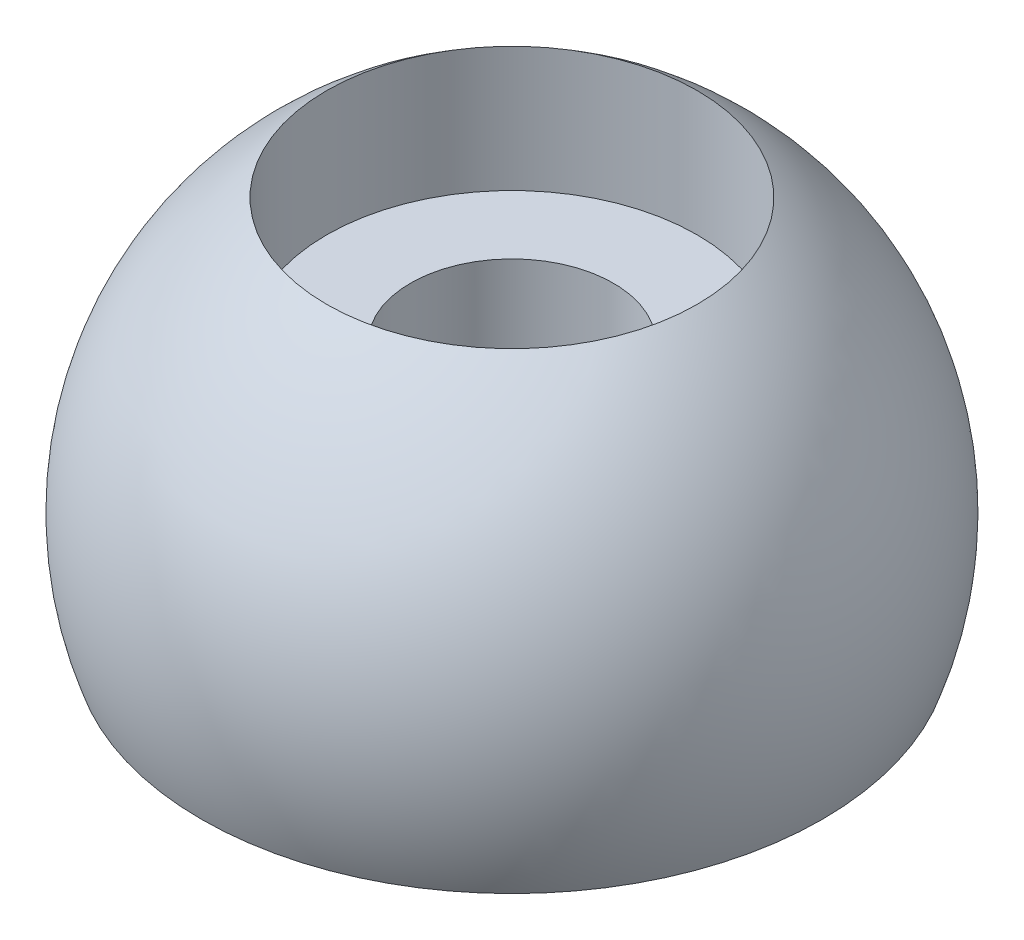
from build123d import *

# Parameters (mm, degrees)
TRUNCATED_BALL_DEPTH      = 11.998522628
TRUNCATED_BALL_DEPTH_BACK = 11.998522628
SKETCH3_R                 = 4.1275
RECESSED_DEPTH            = 0.127


with BuildPart() as part:
    # Sketch1 → Complete_Ball (revolve)
    with BuildSketch(Plane.XY):
        with BuildLine():
            Line((0, 6.35), (0, -6.35))
            ThreePointArc((0, -6.35), (6.35, 0), (0, 6.35))
        make_face()
    revolve(axis=Axis((0, 5.621617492, 0), (0, -1, 0)))

    # Sketch2 → Truncated_ball (cut, two sides: drawn at the far end of the back side and taken through both)
    with BuildSketch(Plane.XY.offset(-TRUNCATED_BALL_DEPTH_BACK)):
        with BuildLine():
            Line((-5.980823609, -2.1336), (5.980823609, -2.1336))
            ThreePointArc((5.980823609, -2.1336), (0, -6.35), (-5.980823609, -2.1336))
        make_face()
    extrude(amount=TRUNCATED_BALL_DEPTH + TRUNCATED_BALL_DEPTH_BACK, mode=Mode.SUBTRACT)

    # Sketch3 → Recessed (cut)
    with BuildSketch(Plane.XZ.offset(2.1336)):
        with Locations(Location((0, 0, 0), (0, 0, 270))):
            Circle(SKETCH3_R)
    extrude(amount=-RECESSED_DEPTH, mode=Mode.SUBTRACT)

    # Sketch5 → Counterbored_hole (revolve, cut)
    with BuildSketch(Plane.XY, mode=Mode.PRIVATE) as counterbored_hole_sk:
        Polygon((1.9558, -2.1336), (1.9558, 2.8448), (3.5687, 2.8448), (3.5687, 6.35), (0, 6.35), (0, -2.1336), align=None)
    revolve(counterbored_hole_sk.sketch.rotate(Axis((0, 7.818373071, 0), (0, -1, 0)), 90), axis=Axis((0, 7.818373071, 0), (0, -1, 0)), mode=Mode.SUBTRACT)


solid = part.part
